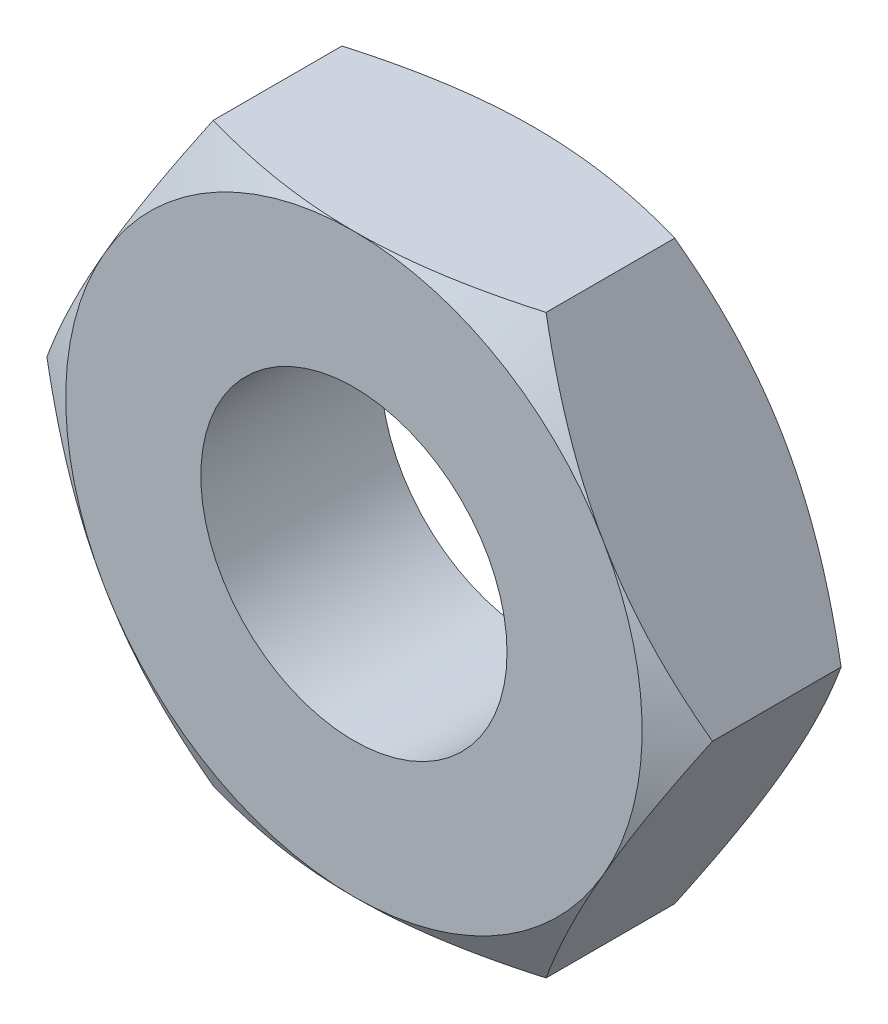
from build123d import *

# Parameters (mm, degrees)
EXTRUDE1_DEPTH = 2.5
TAPPED_HOLE1_D = 8.5


with BuildPart() as part:
    # Sketch1 → Extrude1 (new, symmetric)
    with BuildSketch(Plane.XY):
        Polygon((4.618802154, 8), (-4.618802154, 8), (-9.237604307, 0), (-4.618802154, -8), (4.618802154, -8), (9.237604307, 0), align=None)
    extrude(amount=EXTRUDE1_DEPTH, both=True)

    # Sketch2 → Cut-Revolve1 (revolve, cut)
    with BuildSketch(Plane(origin=(0, 0, 0), x_dir=(0, 0, -1), z_dir=(1, 0, 0))):
        Polygon((-2.5, 8), (-2.5, 16), (2.118802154, 16), align=None)
    cut_revolve1 = revolve(axis=Axis((0, 0, 0), (0, 0, -1)), mode=Mode.SUBTRACT)

    # Mirror1: Cut-Revolve1 across plane
    add(cut_revolve1.mirror(Plane.XY), mode=Mode.SUBTRACT)

    # Tapped Hole1 (through all)
    with Locations(Plane.XY.offset(2.5)):
        with Locations((0, 0)):
            Hole(TAPPED_HOLE1_D / 2)


solid = part.part
